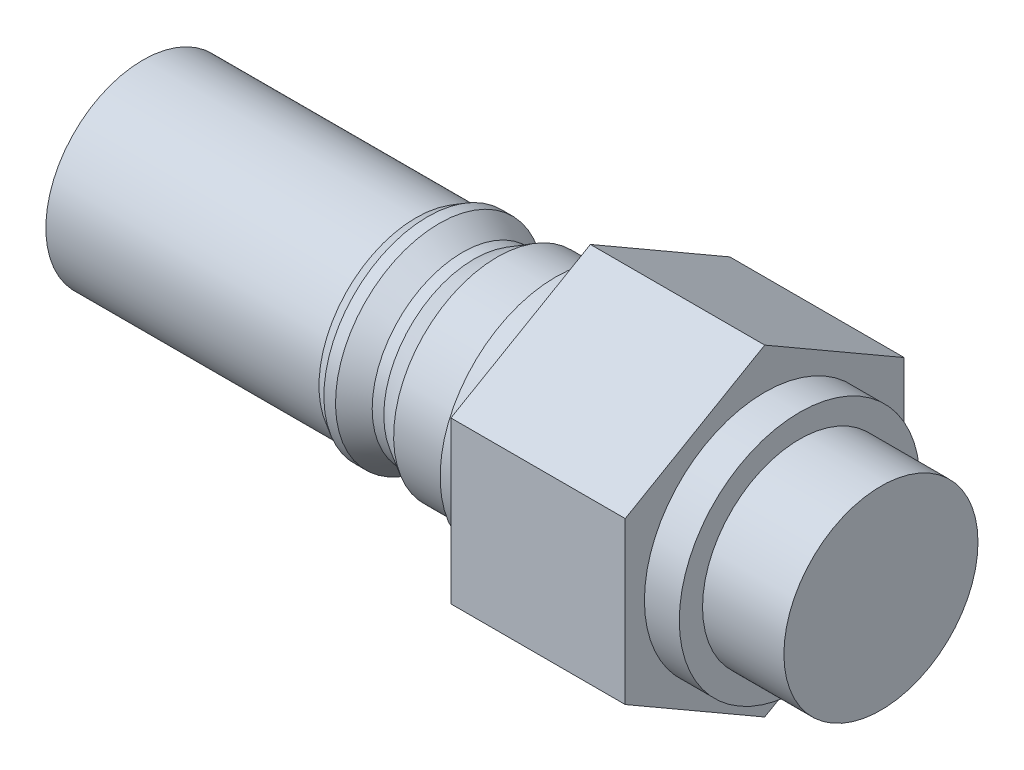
ISO-10303-21;
HEADER;
FILE_DESCRIPTION(('STEP AP214'),'2;1');
FILE_NAME('part.step','',(''),(''),'','','');
FILE_SCHEMA(('AUTOMOTIVE_DESIGN { 1 0 10303 214 1 1 1 1 }'));
ENDSEC;
DATA;
#1=APPLICATION_CONTEXT('core data for automotive mechanical design processes');
#2=APPLICATION_PROTOCOL_DEFINITION('international standard','automotive_design',2000,#1);
#3=PRODUCT_CONTEXT('',#1,'mechanical');
#4=PRODUCT('Part','Part','',(#3));
#5=PRODUCT_RELATED_PRODUCT_CATEGORY('part','',(#4));
#6=PRODUCT_DEFINITION_FORMATION('','',#4);
#7=PRODUCT_DEFINITION_CONTEXT('part definition',#1,'design');
#8=PRODUCT_DEFINITION('design','',#6,#7);
#9=PRODUCT_DEFINITION_SHAPE('','',#8);
#10=(LENGTH_UNIT() NAMED_UNIT(*) SI_UNIT(.MILLI.,.METRE.));
#11=(NAMED_UNIT(*) PLANE_ANGLE_UNIT() SI_UNIT($,.RADIAN.));
#12=(NAMED_UNIT(*) SI_UNIT($,.STERADIAN.) SOLID_ANGLE_UNIT());
#13=UNCERTAINTY_MEASURE_WITH_UNIT(LENGTH_MEASURE(1.E-05),#10,'distance_accuracy_value','');
#14=(GEOMETRIC_REPRESENTATION_CONTEXT(3) GLOBAL_UNCERTAINTY_ASSIGNED_CONTEXT((#13)) GLOBAL_UNIT_ASSIGNED_CONTEXT((#10,
#11,#12)) REPRESENTATION_CONTEXT('',''));
#15=CARTESIAN_POINT('',(0.,0.,0.));
#16=DIRECTION('',(0.,0.,1.));
#17=DIRECTION('',(1.,0.,0.));
#18=AXIS2_PLACEMENT_3D('',#15,#16,#17);
#19=CARTESIAN_POINT('',(0.,0.,0.));
#20=DIRECTION('',(-1.,0.,0.));
#21=DIRECTION('',(0.,-1.,0.));
#22=AXIS2_PLACEMENT_3D('',#19,#20,#21);
#23=PLANE('',#22);
#24=CARTESIAN_POINT('',(0.,0.,0.));
#25=DIRECTION('',(1.,0.,0.));
#26=DIRECTION('',(0.,1.,0.));
#27=AXIS2_PLACEMENT_3D('',#24,#25,#26);
#28=CIRCLE('',#27,8.35);
#29=CARTESIAN_POINT('',(0.,8.35,0.));
#30=VERTEX_POINT('',#29);
#31=EDGE_CURVE('E11',#30,#30,#28,.T.);
#32=ORIENTED_EDGE('',*,*,#31,.F.);
#33=EDGE_LOOP('',(#32));
#34=FACE_BOUND('',#33,.T.);
#35=ADVANCED_FACE('F33',(#34),#23,.T.);
#36=CARTESIAN_POINT('',(38.5,0.,0.));
#37=DIRECTION('',(1.,0.,0.));
#38=DIRECTION('',(0.,1.,0.));
#39=AXIS2_PLACEMENT_3D('',#36,#37,#38);
#40=CYLINDRICAL_SURFACE('',#39,8.35);
#41=ORIENTED_EDGE('',*,*,#31,.T.);
#42=EDGE_LOOP('',(#41));
#43=FACE_BOUND('',#42,.T.);
#44=CARTESIAN_POINT('',(23.5,0.,0.));
#45=DIRECTION('',(1.,0.,0.));
#46=DIRECTION('',(0.,1.,0.));
#47=AXIS2_PLACEMENT_3D('',#44,#45,#46);
#48=CIRCLE('',#47,8.35);
#49=CARTESIAN_POINT('',(23.5,8.35,0.));
#50=VERTEX_POINT('',#49);
#51=EDGE_CURVE('E41',#50,#50,#48,.T.);
#52=ORIENTED_EDGE('',*,*,#51,.F.);
#53=EDGE_LOOP('',(#52));
#54=FACE_BOUND('',#53,.T.);
#55=ADVANCED_FACE('F167',(#43,#54),#40,.T.);
#56=CARTESIAN_POINT('',(24.5,0.,0.));
#57=DIRECTION('',(1.,0.,0.));
#58=DIRECTION('',(0.,1.,0.));
#59=AXIS2_PLACEMENT_3D('',#56,#57,#58);
#60=CONICAL_SURFACE('',#59,8.92735026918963,0.523598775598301);
#61=ORIENTED_EDGE('',*,*,#51,.T.);
#62=EDGE_LOOP('',(#61));
#63=FACE_BOUND('',#62,.T.);
#64=CARTESIAN_POINT('',(24.5,0.,0.));
#65=DIRECTION('',(1.,0.,0.));
#66=DIRECTION('',(0.,1.,0.));
#67=AXIS2_PLACEMENT_3D('',#64,#65,#66);
#68=CIRCLE('',#67,8.92735026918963);
#69=CARTESIAN_POINT('',(24.5,8.92735026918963,0.));
#70=VERTEX_POINT('',#69);
#71=EDGE_CURVE('E159',#70,#70,#68,.T.);
#72=ORIENTED_EDGE('',*,*,#71,.F.);
#73=EDGE_LOOP('',(#72));
#74=FACE_BOUND('',#73,.T.);
#75=ADVANCED_FACE('F164',(#63,#74),#60,.T.);
#76=CARTESIAN_POINT('',(38.5,0.,0.));
#77=DIRECTION('',(1.,0.,0.));
#78=DIRECTION('',(0.,1.,0.));
#79=AXIS2_PLACEMENT_3D('',#76,#77,#78);
#80=CYLINDRICAL_SURFACE('',#79,8.92735026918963);
#81=ORIENTED_EDGE('',*,*,#71,.T.);
#82=EDGE_LOOP('',(#81));
#83=FACE_BOUND('',#82,.T.);
#84=CARTESIAN_POINT('',(25.5,0.,0.));
#85=DIRECTION('',(1.,0.,0.));
#86=DIRECTION('',(0.,1.,0.));
#87=AXIS2_PLACEMENT_3D('',#84,#85,#86);
#88=CIRCLE('',#87,8.92735026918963);
#89=CARTESIAN_POINT('',(25.5,8.92735026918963,0.));
#90=VERTEX_POINT('',#89);
#91=EDGE_CURVE('E156',#90,#90,#88,.T.);
#92=ORIENTED_EDGE('',*,*,#91,.F.);
#93=EDGE_LOOP('',(#92));
#94=FACE_BOUND('',#93,.T.);
#95=ADVANCED_FACE('F174',(#83,#94),#80,.T.);
#96=CARTESIAN_POINT('',(27.5,0.,0.));
#97=DIRECTION('',(-1.,0.,0.));
#98=DIRECTION('',(0.,-1.,0.));
#99=AXIS2_PLACEMENT_3D('',#96,#97,#98);
#100=CONICAL_SURFACE('',#99,7.77264973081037,0.523598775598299);
#101=ORIENTED_EDGE('',*,*,#91,.T.);
#102=EDGE_LOOP('',(#101));
#103=FACE_BOUND('',#102,.T.);
#104=CARTESIAN_POINT('',(27.5,0.,0.));
#105=DIRECTION('',(1.,0.,0.));
#106=DIRECTION('',(0.,1.,0.));
#107=AXIS2_PLACEMENT_3D('',#104,#105,#106);
#108=CIRCLE('',#107,7.77264973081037);
#109=CARTESIAN_POINT('',(27.5,7.77264973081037,0.));
#110=VERTEX_POINT('',#109);
#111=EDGE_CURVE('E153',#110,#110,#108,.T.);
#112=ORIENTED_EDGE('',*,*,#111,.F.);
#113=EDGE_LOOP('',(#112));
#114=FACE_BOUND('',#113,.T.);
#115=ADVANCED_FACE('F180',(#103,#114),#100,.T.);
#116=CARTESIAN_POINT('',(38.5,0.,0.));
#117=DIRECTION('',(1.,0.,0.));
#118=DIRECTION('',(0.,1.,0.));
#119=AXIS2_PLACEMENT_3D('',#116,#117,#118);
#120=CYLINDRICAL_SURFACE('',#119,7.77264973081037);
#121=ORIENTED_EDGE('',*,*,#111,.T.);
#122=EDGE_LOOP('',(#121));
#123=FACE_BOUND('',#122,.T.);
#124=CARTESIAN_POINT('',(28.5,0.,0.));
#125=DIRECTION('',(1.,0.,0.));
#126=DIRECTION('',(0.,1.,0.));
#127=AXIS2_PLACEMENT_3D('',#124,#125,#126);
#128=CIRCLE('',#127,7.77264973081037);
#129=CARTESIAN_POINT('',(28.5,7.77264973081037,0.));
#130=VERTEX_POINT('',#129);
#131=EDGE_CURVE('E150',#130,#130,#128,.T.);
#132=ORIENTED_EDGE('',*,*,#131,.F.);
#133=EDGE_LOOP('',(#132));
#134=FACE_BOUND('',#133,.T.);
#135=ADVANCED_FACE('F184',(#123,#134),#120,.T.);
#136=CARTESIAN_POINT('',(30.5,0.,0.));
#137=DIRECTION('',(1.,0.,0.));
#138=DIRECTION('',(0.,1.,0.));
#139=AXIS2_PLACEMENT_3D('',#136,#137,#138);
#140=CONICAL_SURFACE('',#139,8.92735026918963,0.523598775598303);
#141=ORIENTED_EDGE('',*,*,#131,.T.);
#142=EDGE_LOOP('',(#141));
#143=FACE_BOUND('',#142,.T.);
#144=CARTESIAN_POINT('',(30.5,0.,0.));
#145=DIRECTION('',(1.,0.,0.));
#146=DIRECTION('',(0.,1.,0.));
#147=AXIS2_PLACEMENT_3D('',#144,#145,#146);
#148=CIRCLE('',#147,8.92735026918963);
#149=CARTESIAN_POINT('',(30.5,8.92735026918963,0.));
#150=VERTEX_POINT('',#149);
#151=EDGE_CURVE('E147',#150,#150,#148,.T.);
#152=ORIENTED_EDGE('',*,*,#151,.F.);
#153=EDGE_LOOP('',(#152));
#154=FACE_BOUND('',#153,.T.);
#155=ADVANCED_FACE('F188',(#143,#154),#140,.T.);
#156=CARTESIAN_POINT('',(38.5,0.,0.));
#157=DIRECTION('',(1.,0.,0.));
#158=DIRECTION('',(0.,1.,0.));
#159=AXIS2_PLACEMENT_3D('',#156,#157,#158);
#160=CYLINDRICAL_SURFACE('',#159,8.92735026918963);
#161=ORIENTED_EDGE('',*,*,#151,.T.);
#162=EDGE_LOOP('',(#161));
#163=FACE_BOUND('',#162,.T.);
#164=CARTESIAN_POINT('',(35.5,0.,0.));
#165=DIRECTION('',(1.,0.,0.));
#166=DIRECTION('',(0.,1.,0.));
#167=AXIS2_PLACEMENT_3D('',#164,#165,#166);
#168=CIRCLE('',#167,8.92735026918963);
#169=CARTESIAN_POINT('',(35.5,8.92735026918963,0.));
#170=VERTEX_POINT('',#169);
#171=EDGE_CURVE('E144',#170,#170,#168,.T.);
#172=ORIENTED_EDGE('',*,*,#171,.F.);
#173=EDGE_LOOP('',(#172));
#174=FACE_BOUND('',#173,.T.);
#175=ADVANCED_FACE('F192',(#163,#174),#160,.T.);
#176=CARTESIAN_POINT('',(35.5,8.92735026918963,0.));
#177=DIRECTION('',(-1.,0.,0.));
#178=DIRECTION('',(0.,-1.,0.));
#179=AXIS2_PLACEMENT_3D('',#176,#177,#178);
#180=PLANE('',#179);
#181=ORIENTED_EDGE('',*,*,#171,.T.);
#182=EDGE_LOOP('',(#181));
#183=FACE_BOUND('',#182,.T.);
#184=CARTESIAN_POINT('',(35.5,0.,0.));
#185=DIRECTION('',(1.,0.,0.));
#186=DIRECTION('',(0.,1.,0.));
#187=AXIS2_PLACEMENT_3D('',#184,#185,#186);
#188=CIRCLE('',#187,9.92735026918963);
#189=CARTESIAN_POINT('',(35.5,9.92735026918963,0.));
#190=VERTEX_POINT('',#189);
#191=EDGE_CURVE('E141',#190,#190,#188,.T.);
#192=ORIENTED_EDGE('',*,*,#191,.F.);
#193=EDGE_LOOP('',(#192));
#194=FACE_BOUND('',#193,.T.);
#195=ADVANCED_FACE('F196',(#183,#194),#180,.T.);
#196=CARTESIAN_POINT('',(38.5,0.,0.));
#197=DIRECTION('',(1.,0.,0.));
#198=DIRECTION('',(0.,1.,0.));
#199=AXIS2_PLACEMENT_3D('',#196,#197,#198);
#200=CYLINDRICAL_SURFACE('',#199,9.92735026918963);
#201=ORIENTED_EDGE('',*,*,#191,.T.);
#202=EDGE_LOOP('',(#201));
#203=FACE_BOUND('',#202,.T.);
#204=CARTESIAN_POINT('',(38.5,0.,0.));
#205=DIRECTION('',(1.,0.,0.));
#206=DIRECTION('',(0.,1.,0.));
#207=AXIS2_PLACEMENT_3D('',#204,#205,#206);
#208=CIRCLE('',#207,9.92735026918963);
#209=CARTESIAN_POINT('',(38.5,9.92735026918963,0.));
#210=VERTEX_POINT('',#209);
#211=EDGE_CURVE('E138',#210,#210,#208,.T.);
#212=ORIENTED_EDGE('',*,*,#211,.F.);
#213=EDGE_LOOP('',(#212));
#214=FACE_BOUND('',#213,.T.);
#215=ADVANCED_FACE('F200',(#203,#214),#200,.T.);
#216=CARTESIAN_POINT('',(53.5,6.92820323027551,-12.));
#217=DIRECTION('',(0.,-0.866025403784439,0.5));
#218=DIRECTION('',(0.,-0.5,-0.866025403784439));
#219=AXIS2_PLACEMENT_3D('',#216,#217,#218);
#220=PLANE('',#219);
#221=DIRECTION('',(0.,0.5,0.866025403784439));
#222=VECTOR('',#221,1.);
#223=CARTESIAN_POINT('',(38.5,6.92820323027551,-12.));
#224=LINE('',#223,#222);
#225=CARTESIAN_POINT('',(38.5,6.92820323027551,-12.));
#226=VERTEX_POINT('',#225);
#227=CARTESIAN_POINT('',(38.5,13.856406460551,0.));
#228=VERTEX_POINT('',#227);
#229=EDGE_CURVE('E118',#226,#228,#224,.T.);
#230=ORIENTED_EDGE('',*,*,#229,.T.);
#231=DIRECTION('',(-1.,0.,0.));
#232=VECTOR('',#231,1.);
#233=CARTESIAN_POINT('',(53.5,13.856406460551,0.));
#234=LINE('',#233,#232);
#235=CARTESIAN_POINT('',(53.5,13.856406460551,0.));
#236=VERTEX_POINT('',#235);
#237=EDGE_CURVE('E136',#236,#228,#234,.T.);
#238=ORIENTED_EDGE('',*,*,#237,.F.);
#239=DIRECTION('',(0.,0.5,0.866025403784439));
#240=VECTOR('',#239,1.);
#241=CARTESIAN_POINT('',(53.5,6.92820323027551,-12.));
#242=LINE('',#241,#240);
#243=CARTESIAN_POINT('',(53.5,6.92820323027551,-12.));
#244=VERTEX_POINT('',#243);
#245=EDGE_CURVE('E129',#244,#236,#242,.T.);
#246=ORIENTED_EDGE('',*,*,#245,.F.);
#247=DIRECTION('',(-1.,0.,0.));
#248=VECTOR('',#247,1.);
#249=CARTESIAN_POINT('',(53.5,6.92820323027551,-12.));
#250=LINE('',#249,#248);
#251=EDGE_CURVE('E114',#244,#226,#250,.T.);
#252=ORIENTED_EDGE('',*,*,#251,.T.);
#253=EDGE_LOOP('',(#230,#238,#246,#252));
#254=FACE_BOUND('',#253,.T.);
#255=ADVANCED_FACE('F204',(#254),#220,.F.);
#256=CARTESIAN_POINT('',(53.5,13.856406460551,0.));
#257=DIRECTION('',(0.,-0.866025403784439,-0.5));
#258=DIRECTION('',(0.,0.5,-0.866025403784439));
#259=AXIS2_PLACEMENT_3D('',#256,#257,#258);
#260=PLANE('',#259);
#261=DIRECTION('',(0.,-0.5,0.866025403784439));
#262=VECTOR('',#261,1.);
#263=CARTESIAN_POINT('',(38.5,13.856406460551,0.));
#264=LINE('',#263,#262);
#265=CARTESIAN_POINT('',(38.5,6.92820323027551,12.));
#266=VERTEX_POINT('',#265);
#267=EDGE_CURVE('E121',#228,#266,#264,.T.);
#268=ORIENTED_EDGE('',*,*,#267,.T.);
#269=DIRECTION('',(-1.,0.,0.));
#270=VECTOR('',#269,1.);
#271=CARTESIAN_POINT('',(53.5,6.92820323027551,12.));
#272=LINE('',#271,#270);
#273=CARTESIAN_POINT('',(53.5,6.92820323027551,12.));
#274=VERTEX_POINT('',#273);
#275=EDGE_CURVE('E133',#274,#266,#272,.T.);
#276=ORIENTED_EDGE('',*,*,#275,.F.);
#277=DIRECTION('',(0.,-0.5,0.866025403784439));
#278=VECTOR('',#277,1.);
#279=CARTESIAN_POINT('',(53.5,13.856406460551,0.));
#280=LINE('',#279,#278);
#281=EDGE_CURVE('E87',#236,#274,#280,.T.);
#282=ORIENTED_EDGE('',*,*,#281,.F.);
#283=ORIENTED_EDGE('',*,*,#237,.T.);
#284=EDGE_LOOP('',(#268,#276,#282,#283));
#285=FACE_BOUND('',#284,.T.);
#286=ADVANCED_FACE('F208',(#285),#260,.F.);
#287=CARTESIAN_POINT('',(53.5,6.92820323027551,12.));
#288=DIRECTION('',(0.,0.,-1.));
#289=DIRECTION('',(-1.,0.,0.));
#290=AXIS2_PLACEMENT_3D('',#287,#288,#289);
#291=PLANE('',#290);
#292=DIRECTION('',(0.,-1.,0.));
#293=VECTOR('',#292,1.);
#294=CARTESIAN_POINT('',(38.5,6.92820323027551,12.));
#295=LINE('',#294,#293);
#296=CARTESIAN_POINT('',(38.5,-6.92820323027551,12.));
#297=VERTEX_POINT('',#296);
#298=EDGE_CURVE('E124',#266,#297,#295,.T.);
#299=ORIENTED_EDGE('',*,*,#298,.T.);
#300=DIRECTION('',(-1.,0.,0.));
#301=VECTOR('',#300,1.);
#302=CARTESIAN_POINT('',(53.5,-6.92820323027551,12.));
#303=LINE('',#302,#301);
#304=CARTESIAN_POINT('',(53.5,-6.92820323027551,12.));
#305=VERTEX_POINT('',#304);
#306=EDGE_CURVE('E109',#305,#297,#303,.T.);
#307=ORIENTED_EDGE('',*,*,#306,.F.);
#308=DIRECTION('',(0.,-1.,0.));
#309=VECTOR('',#308,1.);
#310=CARTESIAN_POINT('',(53.5,6.92820323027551,12.));
#311=LINE('',#310,#309);
#312=EDGE_CURVE('E100',#274,#305,#311,.T.);
#313=ORIENTED_EDGE('',*,*,#312,.F.);
#314=ORIENTED_EDGE('',*,*,#275,.T.);
#315=EDGE_LOOP('',(#299,#307,#313,#314));
#316=FACE_BOUND('',#315,.T.);
#317=ADVANCED_FACE('F212',(#316),#291,.F.);
#318=CARTESIAN_POINT('',(53.5,-6.92820323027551,12.));
#319=DIRECTION('',(0.,0.866025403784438,-0.5));
#320=DIRECTION('',(0.,0.5,0.866025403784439));
#321=AXIS2_PLACEMENT_3D('',#318,#319,#320);
#322=PLANE('',#321);
#323=DIRECTION('',(0.,-0.5,-0.866025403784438));
#324=VECTOR('',#323,1.);
#325=CARTESIAN_POINT('',(38.5,-6.92820323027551,12.));
#326=LINE('',#325,#324);
#327=CARTESIAN_POINT('',(38.5,-13.856406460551,0.));
#328=VERTEX_POINT('',#327);
#329=EDGE_CURVE('E108',#297,#328,#326,.T.);
#330=ORIENTED_EDGE('',*,*,#329,.T.);
#331=DIRECTION('',(-1.,0.,0.));
#332=VECTOR('',#331,1.);
#333=CARTESIAN_POINT('',(53.5,-13.856406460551,0.));
#334=LINE('',#333,#332);
#335=CARTESIAN_POINT('',(53.5,-13.856406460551,0.));
#336=VERTEX_POINT('',#335);
#337=EDGE_CURVE('E105',#336,#328,#334,.T.);
#338=ORIENTED_EDGE('',*,*,#337,.F.);
#339=DIRECTION('',(0.,-0.5,-0.866025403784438));
#340=VECTOR('',#339,1.);
#341=CARTESIAN_POINT('',(53.5,-6.92820323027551,12.));
#342=LINE('',#341,#340);
#343=EDGE_CURVE('E94',#305,#336,#342,.T.);
#344=ORIENTED_EDGE('',*,*,#343,.F.);
#345=ORIENTED_EDGE('',*,*,#306,.T.);
#346=EDGE_LOOP('',(#330,#338,#344,#345));
#347=FACE_BOUND('',#346,.T.);
#348=ADVANCED_FACE('F106',(#347),#322,.F.);
#349=CARTESIAN_POINT('',(53.5,-13.856406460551,0.));
#350=DIRECTION('',(0.,0.866025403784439,0.5));
#351=DIRECTION('',(0.,-0.5,0.866025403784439));
#352=AXIS2_PLACEMENT_3D('',#349,#350,#351);
#353=PLANE('',#352);
#354=DIRECTION('',(0.,0.5,-0.866025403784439));
#355=VECTOR('',#354,1.);
#356=CARTESIAN_POINT('',(38.5,-13.856406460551,0.));
#357=LINE('',#356,#355);
#358=CARTESIAN_POINT('',(38.5,-6.92820323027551,-12.));
#359=VERTEX_POINT('',#358);
#360=EDGE_CURVE('E72',#328,#359,#357,.T.);
#361=ORIENTED_EDGE('',*,*,#360,.T.);
#362=DIRECTION('',(-1.,0.,0.));
#363=VECTOR('',#362,1.);
#364=CARTESIAN_POINT('',(53.5,-6.92820323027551,-12.));
#365=LINE('',#364,#363);
#366=CARTESIAN_POINT('',(53.5,-6.92820323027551,-12.));
#367=VERTEX_POINT('',#366);
#368=EDGE_CURVE('E110',#367,#359,#365,.T.);
#369=ORIENTED_EDGE('',*,*,#368,.F.);
#370=DIRECTION('',(0.,0.5,-0.866025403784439));
#371=VECTOR('',#370,1.);
#372=CARTESIAN_POINT('',(53.5,-13.856406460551,0.));
#373=LINE('',#372,#371);
#374=EDGE_CURVE('E98',#336,#367,#373,.T.);
#375=ORIENTED_EDGE('',*,*,#374,.F.);
#376=ORIENTED_EDGE('',*,*,#337,.T.);
#377=EDGE_LOOP('',(#361,#369,#375,#376));
#378=FACE_BOUND('',#377,.T.);
#379=ADVANCED_FACE('F112',(#378),#353,.F.);
#380=CARTESIAN_POINT('',(53.5,-6.92820323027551,-12.));
#381=DIRECTION('',(0.,0.,1.));
#382=DIRECTION('',(1.,0.,0.));
#383=AXIS2_PLACEMENT_3D('',#380,#381,#382);
#384=PLANE('',#383);
#385=DIRECTION('',(0.,1.,0.));
#386=VECTOR('',#385,1.);
#387=CARTESIAN_POINT('',(38.5,-6.92820323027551,-12.));
#388=LINE('',#387,#386);
#389=EDGE_CURVE('E78',#359,#226,#388,.T.);
#390=ORIENTED_EDGE('',*,*,#389,.T.);
#391=ORIENTED_EDGE('',*,*,#251,.F.);
#392=DIRECTION('',(0.,1.,0.));
#393=VECTOR('',#392,1.);
#394=CARTESIAN_POINT('',(53.5,-6.92820323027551,-12.));
#395=LINE('',#394,#393);
#396=EDGE_CURVE('E49',#367,#244,#395,.T.);
#397=ORIENTED_EDGE('',*,*,#396,.F.);
#398=ORIENTED_EDGE('',*,*,#368,.T.);
#399=EDGE_LOOP('',(#390,#391,#397,#398));
#400=FACE_BOUND('',#399,.T.);
#401=ADVANCED_FACE('F220',(#400),#384,.F.);
#402=CARTESIAN_POINT('',(53.5,0.,0.));
#403=DIRECTION('',(1.,0.,0.));
#404=DIRECTION('',(0.,0.,-1.));
#405=AXIS2_PLACEMENT_3D('',#402,#403,#404);
#406=PLANE('',#405);
#407=CARTESIAN_POINT('',(53.5,0.,0.));
#408=DIRECTION('',(-1.,0.,0.));
#409=DIRECTION('',(0.,0.,1.));
#410=AXIS2_PLACEMENT_3D('',#407,#408,#409);
#411=CIRCLE('',#410,10.35);
#412=CARTESIAN_POINT('',(53.5,0.,10.35));
#413=VERTEX_POINT('',#412);
#414=EDGE_CURVE('E250',#413,#413,#411,.T.);
#415=ORIENTED_EDGE('',*,*,#414,.T.);
#416=EDGE_LOOP('',(#415));
#417=FACE_BOUND('',#416,.T.);
#418=ORIENTED_EDGE('',*,*,#245,.T.);
#419=ORIENTED_EDGE('',*,*,#281,.T.);
#420=ORIENTED_EDGE('',*,*,#312,.T.);
#421=ORIENTED_EDGE('',*,*,#343,.T.);
#422=ORIENTED_EDGE('',*,*,#374,.T.);
#423=ORIENTED_EDGE('',*,*,#396,.T.);
#424=EDGE_LOOP('',(#418,#419,#420,#421,#422,#423));
#425=FACE_BOUND('',#424,.T.);
#426=ADVANCED_FACE('F96',(#417,#425),#406,.T.);
#427=CARTESIAN_POINT('',(38.5,0.,0.));
#428=DIRECTION('',(1.,0.,0.));
#429=DIRECTION('',(0.,0.,-1.));
#430=AXIS2_PLACEMENT_3D('',#427,#428,#429);
#431=PLANE('',#430);
#432=ORIENTED_EDGE('',*,*,#211,.T.);
#433=EDGE_LOOP('',(#432));
#434=FACE_BOUND('',#433,.T.);
#435=ORIENTED_EDGE('',*,*,#229,.F.);
#436=ORIENTED_EDGE('',*,*,#389,.F.);
#437=ORIENTED_EDGE('',*,*,#360,.F.);
#438=ORIENTED_EDGE('',*,*,#329,.F.);
#439=ORIENTED_EDGE('',*,*,#298,.F.);
#440=ORIENTED_EDGE('',*,*,#267,.F.);
#441=EDGE_LOOP('',(#435,#436,#437,#438,#439,#440));
#442=FACE_BOUND('',#441,.T.);
#443=ADVANCED_FACE('F223',(#434,#442),#431,.F.);
#444=CARTESIAN_POINT('',(63.5,0.,0.));
#445=DIRECTION('',(-1.,0.,0.));
#446=DIRECTION('',(0.,0.,1.));
#447=AXIS2_PLACEMENT_3D('',#444,#445,#446);
#448=PLANE('',#447);
#449=CARTESIAN_POINT('',(63.5,0.,0.));
#450=DIRECTION('',(-1.,0.,0.));
#451=DIRECTION('',(0.,0.,1.));
#452=AXIS2_PLACEMENT_3D('',#449,#450,#451);
#453=CIRCLE('',#452,8.35);
#454=CARTESIAN_POINT('',(63.5,0.,8.35));
#455=VERTEX_POINT('',#454);
#456=EDGE_CURVE('E122',#455,#455,#453,.T.);
#457=ORIENTED_EDGE('',*,*,#456,.F.);
#458=EDGE_LOOP('',(#457));
#459=FACE_BOUND('',#458,.T.);
#460=ADVANCED_FACE('F226',(#459),#448,.F.);
#461=CARTESIAN_POINT('',(53.5,0.,0.));
#462=DIRECTION('',(-1.,0.,0.));
#463=DIRECTION('',(0.,0.,1.));
#464=AXIS2_PLACEMENT_3D('',#461,#462,#463);
#465=CYLINDRICAL_SURFACE('',#464,8.35);
#466=CARTESIAN_POINT('',(56.5,0.,0.));
#467=DIRECTION('',(-1.,0.,0.));
#468=DIRECTION('',(0.,0.,1.));
#469=AXIS2_PLACEMENT_3D('',#466,#467,#468);
#470=CIRCLE('',#469,8.35);
#471=CARTESIAN_POINT('',(56.5,0.,8.35));
#472=VERTEX_POINT('',#471);
#473=EDGE_CURVE('E254',#472,#472,#470,.T.);
#474=ORIENTED_EDGE('',*,*,#473,.F.);
#475=EDGE_LOOP('',(#474));
#476=FACE_BOUND('',#475,.T.);
#477=ORIENTED_EDGE('',*,*,#456,.T.);
#478=EDGE_LOOP('',(#477));
#479=FACE_BOUND('',#478,.T.);
#480=ADVANCED_FACE('F233',(#476,#479),#465,.T.);
#481=CARTESIAN_POINT('',(56.5,8.35,0.));
#482=DIRECTION('',(-1.,0.,0.));
#483=DIRECTION('',(0.,0.,1.));
#484=AXIS2_PLACEMENT_3D('',#481,#482,#483);
#485=PLANE('',#484);
#486=CARTESIAN_POINT('',(56.5,0.,0.));
#487=DIRECTION('',(-1.,0.,0.));
#488=DIRECTION('',(0.,0.,1.));
#489=AXIS2_PLACEMENT_3D('',#486,#487,#488);
#490=CIRCLE('',#489,10.35);
#491=CARTESIAN_POINT('',(56.5,0.,10.35));
#492=VERTEX_POINT('',#491);
#493=EDGE_CURVE('E253',#492,#492,#490,.T.);
#494=ORIENTED_EDGE('',*,*,#493,.F.);
#495=EDGE_LOOP('',(#494));
#496=FACE_BOUND('',#495,.T.);
#497=ORIENTED_EDGE('',*,*,#473,.T.);
#498=EDGE_LOOP('',(#497));
#499=FACE_BOUND('',#498,.T.);
#500=ADVANCED_FACE('F237',(#496,#499),#485,.F.);
#501=CARTESIAN_POINT('',(53.5,0.,0.));
#502=DIRECTION('',(-1.,0.,0.));
#503=DIRECTION('',(0.,0.,1.));
#504=AXIS2_PLACEMENT_3D('',#501,#502,#503);
#505=CYLINDRICAL_SURFACE('',#504,10.35);
#506=ORIENTED_EDGE('',*,*,#414,.F.);
#507=EDGE_LOOP('',(#506));
#508=FACE_BOUND('',#507,.T.);
#509=ORIENTED_EDGE('',*,*,#493,.T.);
#510=EDGE_LOOP('',(#509));
#511=FACE_BOUND('',#510,.T.);
#512=ADVANCED_FACE('F241',(#508,#511),#505,.T.);
#513=CLOSED_SHELL('',(#35,#55,#75,#95,#115,#135,#155,#175,#195,#215,#255,#286,#317,#348,#379,
#401,#426,#443,#460,#480,#500,#512));
#514=MANIFOLD_SOLID_BREP('B2',#513);
#515=ADVANCED_BREP_SHAPE_REPRESENTATION('',(#18,#514),#14);
#516=SHAPE_DEFINITION_REPRESENTATION(#9,#515);
ENDSEC;
END-ISO-10303-21;
